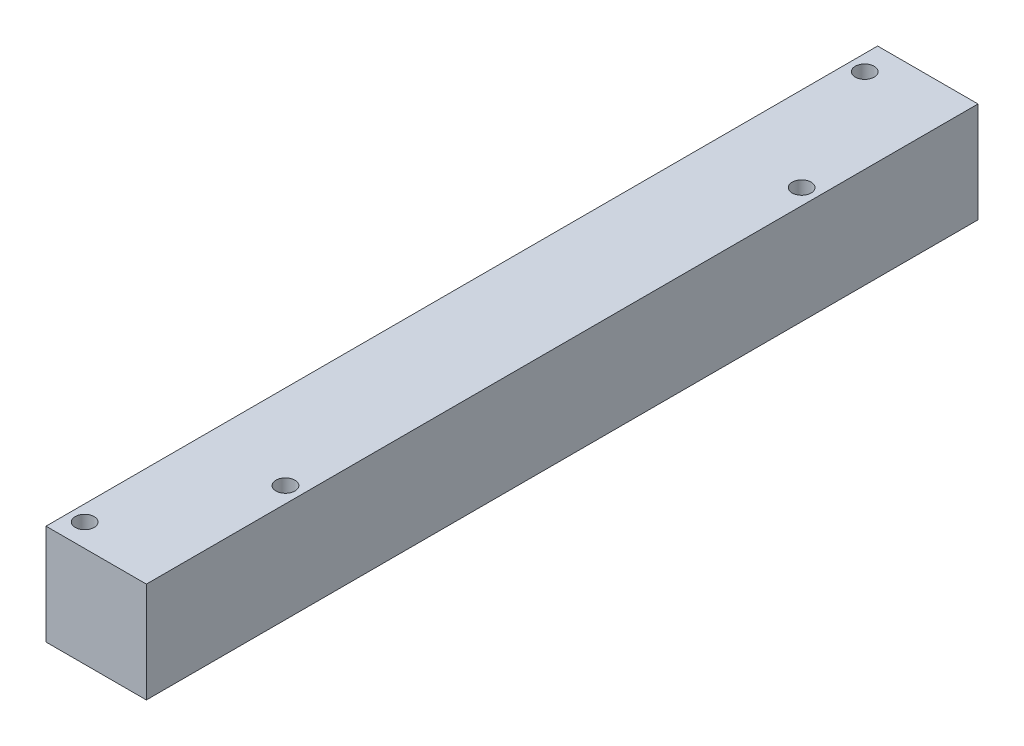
ISO-10303-21;
HEADER;
FILE_DESCRIPTION(('STEP AP214'),'2;1');
FILE_NAME('part.step','',(''),(''),'','','');
FILE_SCHEMA(('AUTOMOTIVE_DESIGN { 1 0 10303 214 1 1 1 1 }'));
ENDSEC;
DATA;
#1=APPLICATION_CONTEXT('core data for automotive mechanical design processes');
#2=APPLICATION_PROTOCOL_DEFINITION('international standard','automotive_design',2000,#1);
#3=PRODUCT_CONTEXT('',#1,'mechanical');
#4=PRODUCT('Part','Part','',(#3));
#5=PRODUCT_RELATED_PRODUCT_CATEGORY('part','',(#4));
#6=PRODUCT_DEFINITION_FORMATION('','',#4);
#7=PRODUCT_DEFINITION_CONTEXT('part definition',#1,'design');
#8=PRODUCT_DEFINITION('design','',#6,#7);
#9=PRODUCT_DEFINITION_SHAPE('','',#8);
#10=(LENGTH_UNIT() NAMED_UNIT(*) SI_UNIT(.MILLI.,.METRE.));
#11=(NAMED_UNIT(*) PLANE_ANGLE_UNIT() SI_UNIT($,.RADIAN.));
#12=(NAMED_UNIT(*) SI_UNIT($,.STERADIAN.) SOLID_ANGLE_UNIT());
#13=UNCERTAINTY_MEASURE_WITH_UNIT(LENGTH_MEASURE(1.E-05),#10,'distance_accuracy_value','');
#14=(GEOMETRIC_REPRESENTATION_CONTEXT(3) GLOBAL_UNCERTAINTY_ASSIGNED_CONTEXT((#13)) GLOBAL_UNIT_ASSIGNED_CONTEXT((#10,
#11,#12)) REPRESENTATION_CONTEXT('',''));
#15=CARTESIAN_POINT('',(0.,0.,0.));
#16=DIRECTION('',(0.,0.,1.));
#17=DIRECTION('',(1.,0.,0.));
#18=AXIS2_PLACEMENT_3D('',#15,#16,#17);
#19=CARTESIAN_POINT('',(0.,0.,0.));
#20=DIRECTION('',(0.,0.,-1.));
#21=DIRECTION('',(0.,-1.,0.));
#22=AXIS2_PLACEMENT_3D('',#19,#20,#21);
#23=PLANE('',#22);
#24=DIRECTION('',(0.,1.,0.));
#25=VECTOR('',#24,1.);
#26=CARTESIAN_POINT('',(8.75,-8.75,0.));
#27=LINE('',#26,#25);
#28=CARTESIAN_POINT('',(8.75,-8.75,0.));
#29=VERTEX_POINT('',#28);
#30=CARTESIAN_POINT('',(8.75,8.75,0.));
#31=VERTEX_POINT('',#30);
#32=EDGE_CURVE('E83',#29,#31,#27,.T.);
#33=ORIENTED_EDGE('',*,*,#32,.F.);
#34=DIRECTION('',(1.,0.,0.));
#35=VECTOR('',#34,1.);
#36=CARTESIAN_POINT('',(-8.75,-8.75,0.));
#37=LINE('',#36,#35);
#38=CARTESIAN_POINT('',(-8.75,-8.75,0.));
#39=VERTEX_POINT('',#38);
#40=EDGE_CURVE('E25',#39,#29,#37,.T.);
#41=ORIENTED_EDGE('',*,*,#40,.F.);
#42=DIRECTION('',(0.,-1.,0.));
#43=VECTOR('',#42,1.);
#44=CARTESIAN_POINT('',(-8.75,-8.75,0.));
#45=LINE('',#44,#43);
#46=CARTESIAN_POINT('',(-8.75,8.75,0.));
#47=VERTEX_POINT('',#46);
#48=EDGE_CURVE('E119',#47,#39,#45,.T.);
#49=ORIENTED_EDGE('',*,*,#48,.F.);
#50=DIRECTION('',(-1.,0.,0.));
#51=VECTOR('',#50,1.);
#52=CARTESIAN_POINT('',(-8.75,8.75,0.));
#53=LINE('',#52,#51);
#54=EDGE_CURVE('E87',#31,#47,#53,.T.);
#55=ORIENTED_EDGE('',*,*,#54,.F.);
#56=EDGE_LOOP('',(#33,#41,#49,#55));
#57=FACE_BOUND('',#56,.T.);
#58=ADVANCED_FACE('F17',(#57),#23,.T.);
#59=CARTESIAN_POINT('',(0.,0.,145.));
#60=DIRECTION('',(0.,0.,-1.));
#61=DIRECTION('',(0.,-1.,0.));
#62=AXIS2_PLACEMENT_3D('',#59,#60,#61);
#63=PLANE('',#62);
#64=DIRECTION('',(0.,1.,0.));
#65=VECTOR('',#64,1.);
#66=CARTESIAN_POINT('',(8.75,-8.75,145.));
#67=LINE('',#66,#65);
#68=CARTESIAN_POINT('',(8.75,-8.75,145.));
#69=VERTEX_POINT('',#68);
#70=CARTESIAN_POINT('',(8.75,8.75,145.));
#71=VERTEX_POINT('',#70);
#72=EDGE_CURVE('E85',#69,#71,#67,.T.);
#73=ORIENTED_EDGE('',*,*,#72,.T.);
#74=DIRECTION('',(-1.,0.,0.));
#75=VECTOR('',#74,1.);
#76=CARTESIAN_POINT('',(-8.75,8.75,145.));
#77=LINE('',#76,#75);
#78=CARTESIAN_POINT('',(-8.75,8.75,145.));
#79=VERTEX_POINT('',#78);
#80=EDGE_CURVE('E115',#71,#79,#77,.T.);
#81=ORIENTED_EDGE('',*,*,#80,.T.);
#82=DIRECTION('',(0.,-1.,0.));
#83=VECTOR('',#82,1.);
#84=CARTESIAN_POINT('',(-8.75,-8.75,145.));
#85=LINE('',#84,#83);
#86=CARTESIAN_POINT('',(-8.75,-8.75,145.));
#87=VERTEX_POINT('',#86);
#88=EDGE_CURVE('E77',#79,#87,#85,.T.);
#89=ORIENTED_EDGE('',*,*,#88,.T.);
#90=DIRECTION('',(1.,0.,0.));
#91=VECTOR('',#90,1.);
#92=CARTESIAN_POINT('',(-8.75,-8.75,145.));
#93=LINE('',#92,#91);
#94=EDGE_CURVE('E11',#87,#69,#93,.T.);
#95=ORIENTED_EDGE('',*,*,#94,.T.);
#96=EDGE_LOOP('',(#73,#81,#89,#95));
#97=FACE_BOUND('',#96,.T.);
#98=ADVANCED_FACE('F127',(#97),#63,.F.);
#99=CARTESIAN_POINT('',(-8.75,-8.75,145.));
#100=DIRECTION('',(0.,1.,0.));
#101=DIRECTION('',(1.,0.,0.));
#102=AXIS2_PLACEMENT_3D('',#99,#100,#101);
#103=PLANE('',#102);
#104=CARTESIAN_POINT('',(6.,-8.75,28.));
#105=DIRECTION('',(0.,1.,0.));
#106=DIRECTION('',(0.,0.,1.));
#107=AXIS2_PLACEMENT_3D('',#104,#105,#106);
#108=CIRCLE('',#107,1.65);
#109=CARTESIAN_POINT('',(6.,-8.75,29.65));
#110=VERTEX_POINT('',#109);
#111=EDGE_CURVE('E103',#110,#110,#108,.T.);
#112=ORIENTED_EDGE('',*,*,#111,.T.);
#113=EDGE_LOOP('',(#112));
#114=FACE_BOUND('',#113,.T.);
#115=CARTESIAN_POINT('',(6.,-8.75,118.));
#116=DIRECTION('',(0.,1.,0.));
#117=DIRECTION('',(0.,0.,1.));
#118=AXIS2_PLACEMENT_3D('',#115,#116,#117);
#119=CIRCLE('',#118,1.65);
#120=CARTESIAN_POINT('',(6.,-8.75,119.65));
#121=VERTEX_POINT('',#120);
#122=EDGE_CURVE('E177',#121,#121,#119,.T.);
#123=ORIENTED_EDGE('',*,*,#122,.T.);
#124=EDGE_LOOP('',(#123));
#125=FACE_BOUND('',#124,.T.);
#126=CARTESIAN_POINT('',(-6.,-8.75,5.));
#127=DIRECTION('',(0.,1.,0.));
#128=DIRECTION('',(0.,0.,1.));
#129=AXIS2_PLACEMENT_3D('',#126,#127,#128);
#130=CIRCLE('',#129,1.65);
#131=CARTESIAN_POINT('',(-6.,-8.75,6.65));
#132=VERTEX_POINT('',#131);
#133=EDGE_CURVE('E180',#132,#132,#130,.T.);
#134=ORIENTED_EDGE('',*,*,#133,.T.);
#135=EDGE_LOOP('',(#134));
#136=FACE_BOUND('',#135,.T.);
#137=CARTESIAN_POINT('',(-6.,-8.75,141.));
#138=DIRECTION('',(0.,1.,0.));
#139=DIRECTION('',(0.,0.,1.));
#140=AXIS2_PLACEMENT_3D('',#137,#138,#139);
#141=CIRCLE('',#140,1.65);
#142=CARTESIAN_POINT('',(-6.,-8.75,142.65));
#143=VERTEX_POINT('',#142);
#144=EDGE_CURVE('E200',#143,#143,#141,.T.);
#145=ORIENTED_EDGE('',*,*,#144,.T.);
#146=EDGE_LOOP('',(#145));
#147=FACE_BOUND('',#146,.T.);
#148=ORIENTED_EDGE('',*,*,#40,.T.);
#149=DIRECTION('',(0.,0.,-1.));
#150=VECTOR('',#149,1.);
#151=CARTESIAN_POINT('',(8.75,-8.75,145.));
#152=LINE('',#151,#150);
#153=EDGE_CURVE('E71',#69,#29,#152,.T.);
#154=ORIENTED_EDGE('',*,*,#153,.F.);
#155=ORIENTED_EDGE('',*,*,#94,.F.);
#156=DIRECTION('',(0.,0.,-1.));
#157=VECTOR('',#156,1.);
#158=CARTESIAN_POINT('',(-8.75,-8.75,145.));
#159=LINE('',#158,#157);
#160=EDGE_CURVE('E74',#87,#39,#159,.T.);
#161=ORIENTED_EDGE('',*,*,#160,.T.);
#162=EDGE_LOOP('',(#148,#154,#155,#161));
#163=FACE_BOUND('',#162,.T.);
#164=ADVANCED_FACE('F70',(#114,#125,#136,#147,#163),#103,.F.);
#165=CARTESIAN_POINT('',(-8.75,-8.75,145.));
#166=DIRECTION('',(1.,0.,0.));
#167=DIRECTION('',(0.,1.,0.));
#168=AXIS2_PLACEMENT_3D('',#165,#166,#167);
#169=PLANE('',#168);
#170=ORIENTED_EDGE('',*,*,#48,.T.);
#171=ORIENTED_EDGE('',*,*,#160,.F.);
#172=ORIENTED_EDGE('',*,*,#88,.F.);
#173=DIRECTION('',(0.,0.,-1.));
#174=VECTOR('',#173,1.);
#175=CARTESIAN_POINT('',(-8.75,8.75,145.));
#176=LINE('',#175,#174);
#177=EDGE_CURVE('E111',#79,#47,#176,.T.);
#178=ORIENTED_EDGE('',*,*,#177,.T.);
#179=EDGE_LOOP('',(#170,#171,#172,#178));
#180=FACE_BOUND('',#179,.T.);
#181=ADVANCED_FACE('F130',(#180),#169,.F.);
#182=CARTESIAN_POINT('',(-8.75,8.75,145.));
#183=DIRECTION('',(0.,-1.,0.));
#184=DIRECTION('',(0.,0.,-1.));
#185=AXIS2_PLACEMENT_3D('',#182,#183,#184);
#186=PLANE('',#185);
#187=CARTESIAN_POINT('',(6.,8.75,28.));
#188=DIRECTION('',(0.,1.,0.));
#189=DIRECTION('',(0.,0.,1.));
#190=AXIS2_PLACEMENT_3D('',#187,#188,#189);
#191=CIRCLE('',#190,1.65);
#192=CARTESIAN_POINT('',(6.,8.75,29.65));
#193=VERTEX_POINT('',#192);
#194=EDGE_CURVE('E93',#193,#193,#191,.T.);
#195=ORIENTED_EDGE('',*,*,#194,.F.);
#196=EDGE_LOOP('',(#195));
#197=FACE_BOUND('',#196,.T.);
#198=CARTESIAN_POINT('',(6.,8.75,118.));
#199=DIRECTION('',(0.,1.,0.));
#200=DIRECTION('',(0.,0.,1.));
#201=AXIS2_PLACEMENT_3D('',#198,#199,#200);
#202=CIRCLE('',#201,1.65);
#203=CARTESIAN_POINT('',(6.,8.75,119.65));
#204=VERTEX_POINT('',#203);
#205=EDGE_CURVE('E171',#204,#204,#202,.T.);
#206=ORIENTED_EDGE('',*,*,#205,.F.);
#207=EDGE_LOOP('',(#206));
#208=FACE_BOUND('',#207,.T.);
#209=CARTESIAN_POINT('',(-6.,8.75,5.));
#210=DIRECTION('',(0.,1.,0.));
#211=DIRECTION('',(0.,0.,1.));
#212=AXIS2_PLACEMENT_3D('',#209,#210,#211);
#213=CIRCLE('',#212,1.65);
#214=CARTESIAN_POINT('',(-6.,8.75,6.65));
#215=VERTEX_POINT('',#214);
#216=EDGE_CURVE('E182',#215,#215,#213,.T.);
#217=ORIENTED_EDGE('',*,*,#216,.F.);
#218=EDGE_LOOP('',(#217));
#219=FACE_BOUND('',#218,.T.);
#220=CARTESIAN_POINT('',(-6.,8.75,141.));
#221=DIRECTION('',(0.,1.,0.));
#222=DIRECTION('',(0.,0.,1.));
#223=AXIS2_PLACEMENT_3D('',#220,#221,#222);
#224=CIRCLE('',#223,1.65);
#225=CARTESIAN_POINT('',(-6.,8.75,142.65));
#226=VERTEX_POINT('',#225);
#227=EDGE_CURVE('E193',#226,#226,#224,.T.);
#228=ORIENTED_EDGE('',*,*,#227,.F.);
#229=EDGE_LOOP('',(#228));
#230=FACE_BOUND('',#229,.T.);
#231=ORIENTED_EDGE('',*,*,#54,.T.);
#232=ORIENTED_EDGE('',*,*,#177,.F.);
#233=ORIENTED_EDGE('',*,*,#80,.F.);
#234=DIRECTION('',(0.,0.,-1.));
#235=VECTOR('',#234,1.);
#236=CARTESIAN_POINT('',(8.75,8.75,145.));
#237=LINE('',#236,#235);
#238=EDGE_CURVE('E92',#71,#31,#237,.T.);
#239=ORIENTED_EDGE('',*,*,#238,.T.);
#240=EDGE_LOOP('',(#231,#232,#233,#239));
#241=FACE_BOUND('',#240,.T.);
#242=ADVANCED_FACE('F132',(#197,#208,#219,#230,#241),#186,.F.);
#243=CARTESIAN_POINT('',(8.75,-8.75,145.));
#244=DIRECTION('',(-1.,0.,0.));
#245=DIRECTION('',(0.,0.,1.));
#246=AXIS2_PLACEMENT_3D('',#243,#244,#245);
#247=PLANE('',#246);
#248=ORIENTED_EDGE('',*,*,#32,.T.);
#249=ORIENTED_EDGE('',*,*,#238,.F.);
#250=ORIENTED_EDGE('',*,*,#72,.F.);
#251=ORIENTED_EDGE('',*,*,#153,.T.);
#252=EDGE_LOOP('',(#248,#249,#250,#251));
#253=FACE_BOUND('',#252,.T.);
#254=ADVANCED_FACE('F81',(#253),#247,.F.);
#255=CARTESIAN_POINT('',(6.,-141.25,28.));
#256=DIRECTION('',(0.,1.,0.));
#257=DIRECTION('',(0.,0.,1.));
#258=AXIS2_PLACEMENT_3D('',#255,#256,#257);
#259=CYLINDRICAL_SURFACE('',#258,1.65);
#260=ORIENTED_EDGE('',*,*,#194,.T.);
#261=EDGE_LOOP('',(#260));
#262=FACE_BOUND('',#261,.T.);
#263=ORIENTED_EDGE('',*,*,#111,.F.);
#264=EDGE_LOOP('',(#263));
#265=FACE_BOUND('',#264,.T.);
#266=ADVANCED_FACE('F141',(#262,#265),#259,.F.);
#267=CARTESIAN_POINT('',(6.,-141.25,118.));
#268=DIRECTION('',(0.,1.,0.));
#269=DIRECTION('',(0.,0.,1.));
#270=AXIS2_PLACEMENT_3D('',#267,#268,#269);
#271=CYLINDRICAL_SURFACE('',#270,1.65);
#272=ORIENTED_EDGE('',*,*,#205,.T.);
#273=EDGE_LOOP('',(#272));
#274=FACE_BOUND('',#273,.T.);
#275=ORIENTED_EDGE('',*,*,#122,.F.);
#276=EDGE_LOOP('',(#275));
#277=FACE_BOUND('',#276,.T.);
#278=ADVANCED_FACE('F160',(#274,#277),#271,.F.);
#279=CARTESIAN_POINT('',(-6.,-141.25,5.));
#280=DIRECTION('',(0.,1.,0.));
#281=DIRECTION('',(0.,0.,1.));
#282=AXIS2_PLACEMENT_3D('',#279,#280,#281);
#283=CYLINDRICAL_SURFACE('',#282,1.65);
#284=ORIENTED_EDGE('',*,*,#216,.T.);
#285=EDGE_LOOP('',(#284));
#286=FACE_BOUND('',#285,.T.);
#287=ORIENTED_EDGE('',*,*,#133,.F.);
#288=EDGE_LOOP('',(#287));
#289=FACE_BOUND('',#288,.T.);
#290=ADVANCED_FACE('F158',(#286,#289),#283,.F.);
#291=CARTESIAN_POINT('',(-6.,-141.25,141.));
#292=DIRECTION('',(0.,1.,0.));
#293=DIRECTION('',(0.,0.,1.));
#294=AXIS2_PLACEMENT_3D('',#291,#292,#293);
#295=CYLINDRICAL_SURFACE('',#294,1.65);
#296=ORIENTED_EDGE('',*,*,#227,.T.);
#297=EDGE_LOOP('',(#296));
#298=FACE_BOUND('',#297,.T.);
#299=ORIENTED_EDGE('',*,*,#144,.F.);
#300=EDGE_LOOP('',(#299));
#301=FACE_BOUND('',#300,.T.);
#302=ADVANCED_FACE('F214',(#298,#301),#295,.F.);
#303=CLOSED_SHELL('',(#58,#98,#164,#181,#242,#254,#266,#278,#290,#302));
#304=MANIFOLD_SOLID_BREP('B1',#303);
#305=ADVANCED_BREP_SHAPE_REPRESENTATION('',(#18,#304),#14);
#306=SHAPE_DEFINITION_REPRESENTATION(#9,#305);
ENDSEC;
END-ISO-10303-21;
